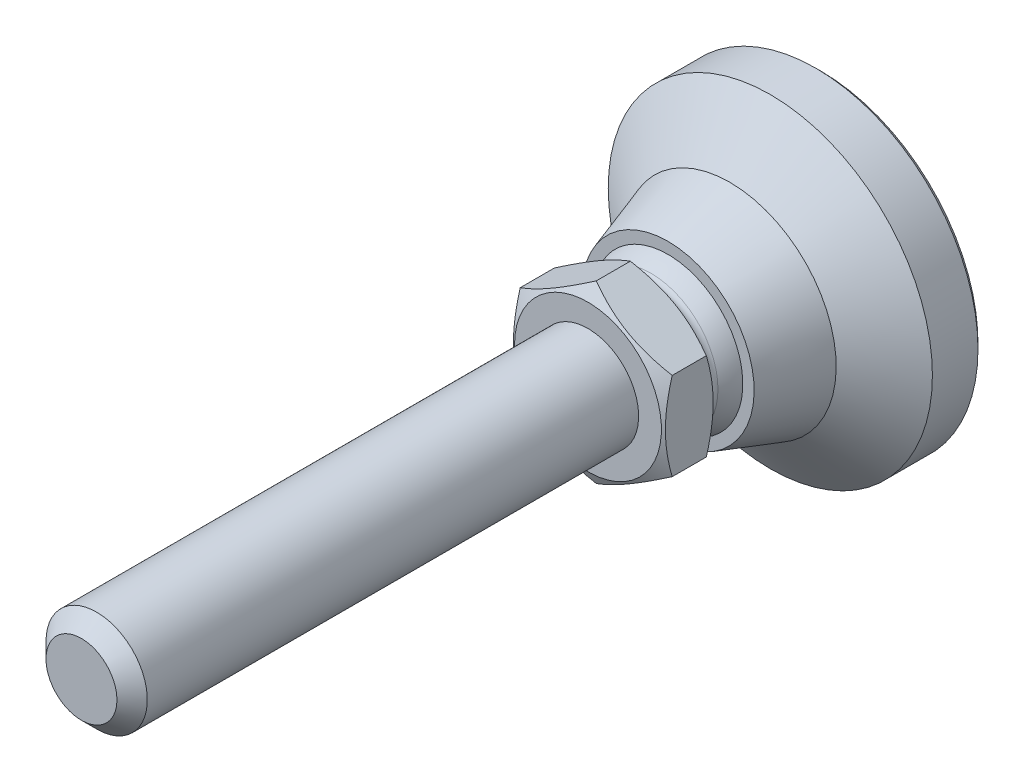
ISO-10303-21;
HEADER;
FILE_DESCRIPTION(('STEP AP214'),'2;1');
FILE_NAME('part.step','',(''),(''),'','','');
FILE_SCHEMA(('AUTOMOTIVE_DESIGN { 1 0 10303 214 1 1 1 1 }'));
ENDSEC;
DATA;
#1=APPLICATION_CONTEXT('core data for automotive mechanical design processes');
#2=APPLICATION_PROTOCOL_DEFINITION('international standard','automotive_design',2000,#1);
#3=PRODUCT_CONTEXT('',#1,'mechanical');
#4=PRODUCT('Part','Part','',(#3));
#5=PRODUCT_RELATED_PRODUCT_CATEGORY('part','',(#4));
#6=PRODUCT_DEFINITION_FORMATION('','',#4);
#7=PRODUCT_DEFINITION_CONTEXT('part definition',#1,'design');
#8=PRODUCT_DEFINITION('design','',#6,#7);
#9=PRODUCT_DEFINITION_SHAPE('','',#8);
#10=(LENGTH_UNIT() NAMED_UNIT(*) SI_UNIT(.MILLI.,.METRE.));
#11=(NAMED_UNIT(*) PLANE_ANGLE_UNIT() SI_UNIT($,.RADIAN.));
#12=(NAMED_UNIT(*) SI_UNIT($,.STERADIAN.) SOLID_ANGLE_UNIT());
#13=UNCERTAINTY_MEASURE_WITH_UNIT(LENGTH_MEASURE(1.E-05),#10,'distance_accuracy_value','');
#14=(GEOMETRIC_REPRESENTATION_CONTEXT(3) GLOBAL_UNCERTAINTY_ASSIGNED_CONTEXT((#13)) GLOBAL_UNIT_ASSIGNED_CONTEXT((#10,
#11,#12)) REPRESENTATION_CONTEXT('',''));
#15=CARTESIAN_POINT('',(0.,0.,0.));
#16=DIRECTION('',(0.,0.,1.));
#17=DIRECTION('',(1.,0.,0.));
#18=AXIS2_PLACEMENT_3D('',#15,#16,#17);
#19=CARTESIAN_POINT('',(0.,0.,17.2011230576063));
#20=DIRECTION('',(0.,0.,-1.));
#21=DIRECTION('',(0.,1.,0.));
#22=AXIS2_PLACEMENT_3D('',#19,#20,#21);
#23=TOROIDAL_SURFACE('',#22,7.30000010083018,0.799999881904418);
#24=CARTESIAN_POINT('',(0.,0.,18.0000000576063));
#25=DIRECTION('',(0.,0.,1.));
#26=DIRECTION('',(1.,0.,0.));
#27=AXIS2_PLACEMENT_3D('',#24,#25,#26);
#28=CIRCLE('',#27,7.25762853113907);
#29=CARTESIAN_POINT('',(7.25762853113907,0.,18.0000000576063));
#30=VERTEX_POINT('',#29);
#31=EDGE_CURVE('E78',#30,#30,#28,.F.);
#32=ORIENTED_EDGE('',*,*,#31,.T.);
#33=EDGE_LOOP('',(#32));
#34=FACE_BOUND('',#33,.T.);
#35=CARTESIAN_POINT('',(0.,0.,16.7846441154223));
#36=DIRECTION('',(0.,0.,-1.));
#37=DIRECTION('',(0.,1.,0.));
#38=AXIS2_PLACEMENT_3D('',#35,#36,#37);
#39=CIRCLE('',#38,6.61695903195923);
#40=CARTESIAN_POINT('',(-6.61695903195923,0.,16.7846441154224));
#41=VERTEX_POINT('',#40);
#42=EDGE_CURVE('E73',#41,#41,#39,.T.);
#43=ORIENTED_EDGE('',*,*,#42,.F.);
#44=EDGE_LOOP('',(#43));
#45=FACE_BOUND('',#44,.T.);
#46=ADVANCED_FACE('F14',(#34,#45),#23,.F.);
#47=CARTESIAN_POINT('',(0.,0.,12.7499999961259));
#48=DIRECTION('',(0.,0.,-1.));
#49=DIRECTION('',(-1.,0.,0.));
#50=AXIS2_PLACEMENT_3D('',#47,#48,#49);
#51=SPHERICAL_SURFACE('',#50,7.75);
#52=CARTESIAN_POINT('',(0.,0.,15.1));
#53=DIRECTION('',(0.,0.,-1.));
#54=DIRECTION('',(0.,1.,0.));
#55=AXIS2_PLACEMENT_3D('',#52,#53,#54);
#56=CIRCLE('',#55,7.38512017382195);
#57=CARTESIAN_POINT('',(-7.38512017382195,0.,15.1));
#58=VERTEX_POINT('',#57);
#59=EDGE_CURVE('E106',#58,#58,#56,.T.);
#60=CARTESIAN_POINT('',(-7.38512017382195,0.,15.1));
#61=CARTESIAN_POINT('',(-7.37925798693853,0.,15.1184225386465));
#62=CARTESIAN_POINT('',(-7.37332686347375,0.,15.1368231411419));
#63=CARTESIAN_POINT('',(-7.36132708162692,0.,15.1735794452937));
#64=CARTESIAN_POINT('',(-7.35525842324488,0.,15.1919351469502));
#65=CARTESIAN_POINT('',(-7.34298390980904,0.,15.2286006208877));
#66=CARTESIAN_POINT('',(-7.33677805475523,0.,15.2469103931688));
#67=CARTESIAN_POINT('',(-7.32422949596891,0.,15.2834829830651));
#68=CARTESIAN_POINT('',(-7.31788679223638,0.,15.3017458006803));
#69=CARTESIAN_POINT('',(-7.30506489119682,0.,15.3382234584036));
#70=CARTESIAN_POINT('',(-7.29858569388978,0.,15.3564382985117));
#71=CARTESIAN_POINT('',(-7.28549116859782,0.,15.3928189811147));
#72=CARTESIAN_POINT('',(-7.2788758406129,0.,15.4109848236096));
#73=CARTESIAN_POINT('',(-7.26550942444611,0.,15.4472664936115));
#74=CARTESIAN_POINT('',(-7.25875833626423,0.,15.4653823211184));
#75=CARTESIAN_POINT('',(-7.24512077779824,0.,15.5015629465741));
#76=CARTESIAN_POINT('',(-7.23823430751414,0.,15.5196277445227));
#77=CARTESIAN_POINT('',(-7.22432637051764,0.,15.5557052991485));
#78=CARTESIAN_POINT('',(-7.21730490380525,0.,15.5737180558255));
#79=CARTESIAN_POINT('',(-7.20312736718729,0.,15.6096905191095));
#80=CARTESIAN_POINT('',(-7.19597129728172,0.,15.6276502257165));
#81=CARTESIAN_POINT('',(-7.18152495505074,0.,15.6635155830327));
#82=CARTESIAN_POINT('',(-7.17423468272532,0.,15.6814212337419));
#83=CARTESIAN_POINT('',(-7.15952034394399,0.,15.7171774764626));
#84=CARTESIAN_POINT('',(-7.15209627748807,0.,15.735028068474));
#85=CARTESIAN_POINT('',(-7.13711476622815,0.,15.7706731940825));
#86=CARTESIAN_POINT('',(-7.12955732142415,0.,15.7884677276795));
#87=CARTESIAN_POINT('',(-7.11430947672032,0.,15.823999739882));
#88=CARTESIAN_POINT('',(-7.10661907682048,0.,15.8417372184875));
#89=CARTESIAN_POINT('',(-7.09110575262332,0.,15.8771541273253));
#90=CARTESIAN_POINT('',(-7.08328282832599,0.,15.8948335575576));
#91=CARTESIAN_POINT('',(-7.06750489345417,0.,15.9301333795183));
#92=CARTESIAN_POINT('',(-7.05954988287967,0.,15.9477537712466));
#93=CARTESIAN_POINT('',(-7.04350822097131,0.,15.982934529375));
#94=CARTESIAN_POINT('',(-7.03542156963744,0.,16.0004948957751));
#95=CARTESIAN_POINT('',(-7.01911707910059,0.,16.0355546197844));
#96=CARTESIAN_POINT('',(-7.01089923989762,0.,16.0530539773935));
#97=CARTESIAN_POINT('',(-6.99433283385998,0.,16.0879907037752));
#98=CARTESIAN_POINT('',(-6.98598426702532,0.,16.1054280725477));
#99=CARTESIAN_POINT('',(-6.96915687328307,0.,16.1402398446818));
#100=CARTESIAN_POINT('',(-6.96067804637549,0.,16.1576142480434));
#101=CARTESIAN_POINT('',(-6.94359060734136,0.,16.1922991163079));
#102=CARTESIAN_POINT('',(-6.9349819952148,0.,16.2096095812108));
#103=CARTESIAN_POINT('',(-6.91763546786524,0.,16.244165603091));
#104=CARTESIAN_POINT('',(-6.90889755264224,0.,16.2614111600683));
#105=CARTESIAN_POINT('',(-6.89129290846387,0.,16.2958364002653));
#106=CARTESIAN_POINT('',(-6.88242617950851,0.,16.3130160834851));
#107=CARTESIAN_POINT('',(-6.86456440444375,0.,16.3473086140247));
#108=CARTESIAN_POINT('',(-6.85556935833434,0.,16.3644214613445));
#109=CARTESIAN_POINT('',(-6.83745145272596,0.,16.3985793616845));
#110=CARTESIAN_POINT('',(-6.828328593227,0.,16.4156244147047));
#111=CARTESIAN_POINT('',(-6.80995557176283,0.,16.4496457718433));
#112=CARTESIAN_POINT('',(-6.80070540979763,0.,16.4666220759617));
#113=CARTESIAN_POINT('',(-6.78207830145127,0.,16.5005049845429));
#114=CARTESIAN_POINT('',(-6.77270135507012,0.,16.5174115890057));
#115=CARTESIAN_POINT('',(-6.75382120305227,0.,16.5511541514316));
#116=CARTESIAN_POINT('',(-6.74431799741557,0.,16.5679901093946));
#117=CARTESIAN_POINT('',(-6.72518585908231,0.,16.6015904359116));
#118=CARTESIAN_POINT('',(-6.71555692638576,0.,16.6183548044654));
#119=CARTESIAN_POINT('',(-6.69617387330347,0.,16.6518110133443));
#120=CARTESIAN_POINT('',(-6.68641975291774,0.,16.6685028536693));
#121=CARTESIAN_POINT('',(-6.66678687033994,0.,16.7018130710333));
#122=CARTESIAN_POINT('',(-6.65690810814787,0.,16.7184314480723));
#123=CARTESIAN_POINT('',(-6.63702649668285,0.,16.7515938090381));
#124=CARTESIAN_POINT('',(-6.6270236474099,0.,16.7681377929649));
#125=CARTESIAN_POINT('',(-6.61695903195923,0.,16.7846441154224));
#126=B_SPLINE_CURVE_WITH_KNOTS('',3,(#60,#61,#62,#63,#64,#65,#66,#67,#68,#69,#70,#71,#72,#73,
#74,#75,#76,#77,#78,#79,#80,#81,#82,#83,#84,#85,#86,#87,#88,#89,#90,#91,#92,#93,#94,#95,#96,#97,
#98,#99,#100,#101,#102,#103,#104,#105,#106,#107,#108,#109,#110,#111,#112,#113,#114,#115,#116,
#117,#118,#119,#120,#121,#122,#123,#124,#125),.UNSPECIFIED.,.F.,.F.,(4,2,2,2,2,2,2,2,2,2,2,2,2,
2,2,2,2,2,2,2,2,2,2,2,2,2,2,2,2,2,2,2,4),(0.,0.0579981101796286,0.11599622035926,
0.173994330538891,0.231992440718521,0.289990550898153,0.347988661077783,0.405986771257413,
0.463984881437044,0.521982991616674,0.579981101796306,0.637979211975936,0.695977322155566,
0.753975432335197,0.811973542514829,0.86997165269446,0.927969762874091,0.98596787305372,
1.04396598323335,1.10196409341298,1.15996220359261,1.21796031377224,1.27595842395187,
1.33395653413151,1.39195464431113,1.44995275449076,1.50795086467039,1.56594897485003,
1.62394708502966,1.68194519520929,1.73994330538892,1.79794141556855,1.85593952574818),.UNSPECIFIED.);
#127=EDGE_CURVE('BSEAM238',#58,#41,#126,.T.);
#128=ORIENTED_EDGE('',*,*,#59,.F.);
#129=ORIENTED_EDGE('',*,*,#42,.T.);
#130=ORIENTED_EDGE('',*,*,#127,.T.);
#131=ORIENTED_EDGE('',*,*,#127,.F.);
#132=EDGE_LOOP('',(#128,#130,#129,#131));
#133=FACE_BOUND('',#132,.T.);
#134=ADVANCED_FACE('F238',(#133),#51,.T.);
#135=CARTESIAN_POINT('',(-7.38512017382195,0.,15.1));
#136=DIRECTION('',(0.,0.,-1.));
#137=DIRECTION('',(0.,1.,0.));
#138=AXIS2_PLACEMENT_3D('',#135,#136,#137);
#139=PLANE('',#138);
#140=CARTESIAN_POINT('',(0.,0.,15.1));
#141=DIRECTION('',(0.,0.,-1.));
#142=DIRECTION('',(0.,1.,0.));
#143=AXIS2_PLACEMENT_3D('',#140,#141,#142);
#144=CIRCLE('',#143,8.5);
#145=CARTESIAN_POINT('',(0.,8.5,15.1));
#146=VERTEX_POINT('',#145);
#147=EDGE_CURVE('E103',#146,#146,#144,.T.);
#148=ORIENTED_EDGE('',*,*,#147,.F.);
#149=EDGE_LOOP('',(#148));
#150=FACE_BOUND('',#149,.T.);
#151=ORIENTED_EDGE('',*,*,#59,.T.);
#152=EDGE_LOOP('',(#151));
#153=FACE_BOUND('',#152,.T.);
#154=ADVANCED_FACE('F244',(#150,#153),#139,.F.);
#155=CARTESIAN_POINT('',(0.,0.,15.1));
#156=DIRECTION('',(0.,0.,-1.));
#157=DIRECTION('',(0.,1.,0.));
#158=AXIS2_PLACEMENT_3D('',#155,#156,#157);
#159=CONICAL_SURFACE('',#158,8.5,0.316824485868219);
#160=CARTESIAN_POINT('',(0.,0.,9.));
#161=DIRECTION('',(0.,0.,-1.));
#162=DIRECTION('',(0.,1.,0.));
#163=AXIS2_PLACEMENT_3D('',#160,#161,#162);
#164=CIRCLE('',#163,10.5);
#165=CARTESIAN_POINT('',(0.,10.5,9.));
#166=VERTEX_POINT('',#165);
#167=EDGE_CURVE('E100',#166,#166,#164,.T.);
#168=ORIENTED_EDGE('',*,*,#167,.F.);
#169=EDGE_LOOP('',(#168));
#170=FACE_BOUND('',#169,.T.);
#171=ORIENTED_EDGE('',*,*,#147,.T.);
#172=EDGE_LOOP('',(#171));
#173=FACE_BOUND('',#172,.T.);
#174=ADVANCED_FACE('F346',(#170,#173),#159,.T.);
#175=CARTESIAN_POINT('',(0.,0.,9.));
#176=DIRECTION('',(0.,0.,-1.));
#177=DIRECTION('',(0.,1.,0.));
#178=AXIS2_PLACEMENT_3D('',#175,#176,#177);
#179=CONICAL_SURFACE('',#178,10.5,0.942000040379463);
#180=CARTESIAN_POINT('',(0.,0.,5.));
#181=DIRECTION('',(0.,0.,-1.));
#182=DIRECTION('',(0.,1.,0.));
#183=AXIS2_PLACEMENT_3D('',#180,#181,#182);
#184=CIRCLE('',#183,16.);
#185=CARTESIAN_POINT('',(0.,16.,5.));
#186=VERTEX_POINT('',#185);
#187=EDGE_CURVE('E97',#186,#186,#184,.T.);
#188=ORIENTED_EDGE('',*,*,#187,.F.);
#189=EDGE_LOOP('',(#188));
#190=FACE_BOUND('',#189,.T.);
#191=ORIENTED_EDGE('',*,*,#167,.T.);
#192=EDGE_LOOP('',(#191));
#193=FACE_BOUND('',#192,.T.);
#194=ADVANCED_FACE('F355',(#190,#193),#179,.T.);
#195=CARTESIAN_POINT('',(0.,0.,0.));
#196=DIRECTION('',(0.,0.,-1.));
#197=DIRECTION('',(0.,1.,0.));
#198=AXIS2_PLACEMENT_3D('',#195,#196,#197);
#199=CYLINDRICAL_SURFACE('',#198,16.);
#200=CARTESIAN_POINT('',(0.,0.,0.5));
#201=DIRECTION('',(0.,0.,-1.));
#202=DIRECTION('',(0.,1.,0.));
#203=AXIS2_PLACEMENT_3D('',#200,#201,#202);
#204=CIRCLE('',#203,16.);
#205=CARTESIAN_POINT('',(0.,16.,0.5));
#206=VERTEX_POINT('',#205);
#207=EDGE_CURVE('E89',#206,#206,#204,.T.);
#208=ORIENTED_EDGE('',*,*,#207,.F.);
#209=EDGE_LOOP('',(#208));
#210=FACE_BOUND('',#209,.T.);
#211=ORIENTED_EDGE('',*,*,#187,.T.);
#212=EDGE_LOOP('',(#211));
#213=FACE_BOUND('',#212,.T.);
#214=ADVANCED_FACE('F364',(#210,#213),#199,.T.);
#215=CARTESIAN_POINT('',(0.,0.,0.5));
#216=DIRECTION('',(0.,0.,1.));
#217=DIRECTION('',(0.,-1.,0.));
#218=AXIS2_PLACEMENT_3D('',#215,#216,#217);
#219=CONICAL_SURFACE('',#218,16.,0.785398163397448);
#220=CARTESIAN_POINT('',(0.,0.,0.));
#221=DIRECTION('',(0.,0.,-1.));
#222=DIRECTION('',(0.,1.,0.));
#223=AXIS2_PLACEMENT_3D('',#220,#221,#222);
#224=CIRCLE('',#223,15.5);
#225=CARTESIAN_POINT('',(0.,15.5,0.));
#226=VERTEX_POINT('',#225);
#227=EDGE_CURVE('E85',#226,#226,#224,.T.);
#228=ORIENTED_EDGE('',*,*,#227,.F.);
#229=EDGE_LOOP('',(#228));
#230=FACE_BOUND('',#229,.T.);
#231=ORIENTED_EDGE('',*,*,#207,.T.);
#232=EDGE_LOOP('',(#231));
#233=FACE_BOUND('',#232,.T.);
#234=ADVANCED_FACE('F269',(#230,#233),#219,.T.);
#235=CARTESIAN_POINT('',(0.,0.,0.));
#236=DIRECTION('',(0.,0.,1.));
#237=DIRECTION('',(0.,-1.,0.));
#238=AXIS2_PLACEMENT_3D('',#235,#236,#237);
#239=PLANE('',#238);
#240=ORIENTED_EDGE('',*,*,#227,.T.);
#241=EDGE_LOOP('',(#240));
#242=FACE_BOUND('',#241,.T.);
#243=ADVANCED_FACE('F264',(#242),#239,.F.);
#244=CARTESIAN_POINT('',(0.,7.25,18.0000000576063));
#245=DIRECTION('',(0.,0.,-1.));
#246=DIRECTION('',(-1.,0.,0.));
#247=AXIS2_PLACEMENT_3D('',#244,#245,#246);
#248=PLANE('',#247);
#249=CARTESIAN_POINT('',(0.,0.,18.0000000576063));
#250=DIRECTION('',(0.,0.,-1.));
#251=DIRECTION('',(-1.,0.,0.));
#252=AXIS2_PLACEMENT_3D('',#249,#250,#251);
#253=CIRCLE('',#252,7.25);
#254=CARTESIAN_POINT('',(-7.25,0.,18.0000000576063));
#255=VERTEX_POINT('',#254);
#256=EDGE_CURVE('E273',#255,#255,#253,.T.);
#257=ORIENTED_EDGE('',*,*,#256,.T.);
#258=EDGE_LOOP('',(#257));
#259=FACE_BOUND('',#258,.T.);
#260=ORIENTED_EDGE('',*,*,#31,.F.);
#261=EDGE_LOOP('',(#260));
#262=FACE_BOUND('',#261,.T.);
#263=ADVANCED_FACE('F126',(#259,#262),#248,.F.);
#264=CARTESIAN_POINT('',(0.,0.,19.4875466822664));
#265=DIRECTION('',(0.,0.,1.));
#266=DIRECTION('',(1.,0.,0.));
#267=AXIS2_PLACEMENT_3D('',#264,#265,#266);
#268=CONICAL_SURFACE('',#267,9.82650633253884,1.0471975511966);
#269=CARTESIAN_POINT('',(-0.000199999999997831,8.66036950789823,18.8142772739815));
#270=CARTESIAN_POINT('',(0.164658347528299,8.56518849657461,18.75933289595));
#271=CARTESIAN_POINT('',(0.330131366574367,8.46965260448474,18.7068821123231));
#272=CARTESIAN_POINT('',(0.662421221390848,8.27780496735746,18.607654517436));
#273=CARTESIAN_POINT('',(0.829238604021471,8.18149290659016,18.5608801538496));
#274=CARTESIAN_POINT('',(1.33236168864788,7.89101465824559,18.4299898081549));
#275=CARTESIAN_POINT('',(1.67065338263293,7.69570185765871,18.3555409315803));
#276=CARTESIAN_POINT('',(2.17690074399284,7.40341980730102,18.2682409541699));
#277=CARTESIAN_POINT('',(2.34334381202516,7.30732385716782,18.2433717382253));
#278=CARTESIAN_POINT('',(2.67698200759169,7.11469775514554,18.2016697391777));
#279=CARTESIAN_POINT('',(2.84417706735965,7.01816764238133,18.1848362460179));
#280=CARTESIAN_POINT('',(3.17885756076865,6.82493976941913,18.1596346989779));
#281=CARTESIAN_POINT('',(3.34634244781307,6.72824232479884,18.1512570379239));
#282=CARTESIAN_POINT('',(3.68145767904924,6.5347634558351,18.1431378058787));
#283=CARTESIAN_POINT('',(3.84908801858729,6.43798203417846,18.1433959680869));
#284=CARTESIAN_POINT('',(4.30833780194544,6.17283404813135,18.1559736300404));
#285=CARTESIAN_POINT('',(4.59980690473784,6.0045542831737,18.1770872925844));
#286=CARTESIAN_POINT('',(5.18080920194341,5.66911245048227,18.2440382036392));
#287=CARTESIAN_POINT('',(5.47034035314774,5.50195156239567,18.2898983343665));
#288=CARTESIAN_POINT('',(6.05251186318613,5.16583468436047,18.404535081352));
#289=CARTESIAN_POINT('',(6.34507876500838,4.99692110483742,18.4737973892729));
#290=CARTESIAN_POINT('',(6.92584963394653,4.66161288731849,18.6309947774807));
#291=CARTESIAN_POINT('',(7.21406103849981,4.49521395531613,18.7188929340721));
#292=CARTESIAN_POINT('',(7.5002,4.33001154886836,18.8142772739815));
#293=B_SPLINE_CURVE_WITH_KNOTS('',3,(#269,#270,#271,#272,#273,#274,#275,#276,#277,#278,#279,
#280,#281,#282,#283,#284,#285,#286,#287,#288,#289,#290,#291,#292),.UNSPECIFIED.,.F.,.F.,(4,2,2,
2,2,2,2,2,2,2,2,4),(0.,0.594350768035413,1.1889569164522,2.38063993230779,2.96188692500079,
3.54308254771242,4.12361709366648,4.70413370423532,5.71473675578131,6.72627588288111,
7.76024925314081,8.7921928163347),.UNSPECIFIED.);
#294=CARTESIAN_POINT('',(0.,8.66025403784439,18.8142106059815));
#295=VERTEX_POINT('',#294);
#296=CARTESIAN_POINT('',(7.5,4.3301270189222,18.8142106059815));
#297=VERTEX_POINT('',#296);
#298=EDGE_CURVE('E69',#295,#297,#293,.T.);
#299=ORIENTED_EDGE('',*,*,#298,.T.);
#300=CARTESIAN_POINT('',(7.5,-11.5576706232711,21.768868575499));
#301=CARTESIAN_POINT('',(7.5,-11.2307045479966,21.6105580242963));
#302=CARTESIAN_POINT('',(7.5,-10.9029799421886,21.4537868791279));
#303=CARTESIAN_POINT('',(7.5,-10.2456099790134,21.1441907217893));
#304=CARTESIAN_POINT('',(7.5,-9.91596432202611,20.9913663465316));
#305=CARTESIAN_POINT('',(7.5,-9.25261455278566,20.6897463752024));
#306=CARTESIAN_POINT('',(7.5,-8.91889806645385,20.5409778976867));
#307=CARTESIAN_POINT('',(7.5,-8.24878495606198,20.2496282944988));
#308=CARTESIAN_POINT('',(7.5,-7.91238846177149,20.1070468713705));
#309=CARTESIAN_POINT('',(7.5,-7.22581294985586,19.8253721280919));
#310=CARTESIAN_POINT('',(7.5,-6.87553160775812,19.6865268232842));
#311=CARTESIAN_POINT('',(7.5,-6.17084463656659,19.4195238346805));
#312=CARTESIAN_POINT('',(7.5,-5.81643854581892,19.2913673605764));
#313=CARTESIAN_POINT('',(7.5,-5.10362143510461,19.0491608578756));
#314=CARTESIAN_POINT('',(7.5,-4.74522044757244,18.93508162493));
#315=CARTESIAN_POINT('',(7.5,-4.02329140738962,18.724736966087));
#316=CARTESIAN_POINT('',(7.5,-3.6597650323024,18.6284658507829));
#317=CARTESIAN_POINT('',(7.5,-2.92931943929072,18.4589198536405));
#318=CARTESIAN_POINT('',(7.5,-2.56242928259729,18.3855231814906));
#319=CARTESIAN_POINT('',(7.5,-2.00881272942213,18.2957984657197));
#320=CARTESIAN_POINT('',(7.5,-1.82371282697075,18.2692840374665));
#321=CARTESIAN_POINT('',(7.5,-1.45261823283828,18.2235669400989));
#322=CARTESIAN_POINT('',(7.5,-1.26662362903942,18.2043635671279));
#323=CARTESIAN_POINT('',(7.5,-0.89638602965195,18.1738882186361));
#324=CARTESIAN_POINT('',(7.5,-0.712151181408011,18.1625176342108));
#325=CARTESIAN_POINT('',(7.5,-0.343366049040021,18.1475723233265));
#326=CARTESIAN_POINT('',(7.5,-0.158815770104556,18.1439974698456));
#327=CARTESIAN_POINT('',(7.5,0.21027122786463,18.1447287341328));
#328=CARTESIAN_POINT('',(7.5,0.394807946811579,18.1490348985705));
#329=CARTESIAN_POINT('',(7.5,0.763538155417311,18.1654242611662));
#330=CARTESIAN_POINT('',(7.5,0.947731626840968,18.1775078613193));
#331=CARTESIAN_POINT('',(7.5,1.39266066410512,18.2158368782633));
#332=CARTESIAN_POINT('',(7.5,1.65307425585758,18.2458975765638));
#333=CARTESIAN_POINT('',(7.5,2.17190768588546,18.3199074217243));
#334=CARTESIAN_POINT('',(7.5,2.43032723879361,18.3638585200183));
#335=CARTESIAN_POINT('',(7.5,3.20233370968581,18.5142115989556));
#336=CARTESIAN_POINT('',(7.5,3.71236757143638,18.6390840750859));
#337=CARTESIAN_POINT('',(7.5,4.47490816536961,18.8548537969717));
#338=CARTESIAN_POINT('',(7.5,4.73138930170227,18.9325065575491));
#339=CARTESIAN_POINT('',(7.5,5.24185921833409,19.0956852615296));
#340=CARTESIAN_POINT('',(7.5,5.49584798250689,19.1812112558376));
#341=CARTESIAN_POINT('',(7.5,6.00141679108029,19.3587802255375));
#342=CARTESIAN_POINT('',(7.5,6.25299764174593,19.4508209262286));
#343=CARTESIAN_POINT('',(7.5,6.75408794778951,19.6403555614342));
#344=CARTESIAN_POINT('',(7.5,7.00359742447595,19.737849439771));
#345=CARTESIAN_POINT('',(7.5,7.58002840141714,19.9691873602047));
#346=CARTESIAN_POINT('',(7.5,7.90627393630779,20.1047123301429));
#347=CARTESIAN_POINT('',(7.5,8.55609583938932,20.3820345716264));
#348=CARTESIAN_POINT('',(7.5,8.87967206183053,20.5238321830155));
#349=CARTESIAN_POINT('',(7.5,9.52463038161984,20.8124742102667));
#350=CARTESIAN_POINT('',(7.5,9.84601206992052,20.9593195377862));
#351=CARTESIAN_POINT('',(7.5,10.4868901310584,21.2570751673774));
#352=CARTESIAN_POINT('',(7.5,10.8063864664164,21.4079855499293));
#353=CARTESIAN_POINT('',(7.5,11.4441033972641,21.7132759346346));
#354=CARTESIAN_POINT('',(7.5,11.762322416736,21.8676592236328));
#355=CARTESIAN_POINT('',(7.5,12.3974133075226,22.1791747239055));
#356=CARTESIAN_POINT('',(7.5,12.714285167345,22.3363069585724));
#357=CARTESIAN_POINT('',(7.5,13.6631175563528,22.8110756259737));
#358=CARTESIAN_POINT('',(7.5,14.2933721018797,23.1321212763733));
#359=CARTESIAN_POINT('',(7.5,15.4999002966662,23.7545318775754));
#360=CARTESIAN_POINT('',(7.5,16.0764321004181,24.0553985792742));
#361=CARTESIAN_POINT('',(7.5,17.2273435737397,24.6612616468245));
#362=CARTESIAN_POINT('',(7.5,17.8017231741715,24.9662581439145));
#363=CARTESIAN_POINT('',(7.5,18.947459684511,25.5786959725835));
#364=CARTESIAN_POINT('',(7.5,19.5188205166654,25.8861299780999));
#365=CARTESIAN_POINT('',(7.5,20.6601587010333,26.5034864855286));
#366=CARTESIAN_POINT('',(7.5,21.2301361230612,26.8134088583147));
#367=CARTESIAN_POINT('',(7.5,21.7996007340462,27.1242643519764));
#368=B_SPLINE_CURVE_WITH_KNOTS('',3,(#300,#301,#302,#303,#304,#305,#306,#307,#308,#309,#310,
#311,#312,#313,#314,#315,#316,#317,#318,#319,#320,#321,#322,#323,#324,#325,#326,#327,#328,#329,
#330,#331,#332,#333,#334,#335,#336,#337,#338,#339,#340,#341,#342,#343,#344,#345,#346,#347,#348,
#349,#350,#351,#352,#353,#354,#355,#356,#357,#358,#359,#360,#361,#362,#363,#364,#365,#366,#367),
.UNSPECIFIED.,.F.,.F.,(4,2,2,2,2,2,2,2,2,2,2,2,2,2,2,2,2,2,2,2,2,2,2,2,2,2,2,2,2,2,2,2,2,4),(0.,
1.08983998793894,2.17985476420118,3.27592891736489,4.37195031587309,5.50220226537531,
6.63258195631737,7.76057568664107,8.88820841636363,10.0097304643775,10.5705765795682,
11.131368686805,11.6849650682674,12.2385524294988,12.7921430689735,13.3457623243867,
14.131745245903,14.9178386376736,16.4909282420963,17.2947994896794,18.0986759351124,
18.9022730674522,19.7058619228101,20.7655995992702,21.8253947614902,22.8853823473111,
23.945390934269,25.0064488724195,26.0675158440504,28.1893926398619,30.1403199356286,
32.0913093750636,34.0377662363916,35.9841227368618),.UNSPECIFIED.);
#369=CARTESIAN_POINT('',(7.5,-4.3301270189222,18.8142106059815));
#370=VERTEX_POINT('',#369);
#371=EDGE_CURVE('E79',#297,#370,#368,.F.);
#372=ORIENTED_EDGE('',*,*,#371,.T.);
#373=CARTESIAN_POINT('',(7.5002,-4.33001154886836,18.8142772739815));
#374=CARTESIAN_POINT('',(7.3353416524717,-4.42519256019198,18.75933289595));
#375=CARTESIAN_POINT('',(7.16986863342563,-4.52072845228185,18.7068821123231));
#376=CARTESIAN_POINT('',(6.83757877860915,-4.71257608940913,18.607654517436));
#377=CARTESIAN_POINT('',(6.67076139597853,-4.80888815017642,18.5608801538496));
#378=CARTESIAN_POINT('',(6.16763831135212,-5.09936639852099,18.4299898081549));
#379=CARTESIAN_POINT('',(5.82934661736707,-5.29467919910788,18.3555409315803));
#380=CARTESIAN_POINT('',(5.32309925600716,-5.58696124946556,18.26824095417));
#381=CARTESIAN_POINT('',(5.15665618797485,-5.68305719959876,18.2433717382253));
#382=CARTESIAN_POINT('',(4.82301799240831,-5.87568330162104,18.2016697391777));
#383=CARTESIAN_POINT('',(4.65582293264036,-5.97221341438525,18.1848362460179));
#384=CARTESIAN_POINT('',(4.32114243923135,-6.16544128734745,18.1596346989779));
#385=CARTESIAN_POINT('',(4.15365755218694,-6.26213873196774,18.1512570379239));
#386=CARTESIAN_POINT('',(3.81854232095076,-6.45561760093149,18.1431378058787));
#387=CARTESIAN_POINT('',(3.65091198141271,-6.55239902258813,18.1433959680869));
#388=CARTESIAN_POINT('',(3.19166219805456,-6.81754700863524,18.1559736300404));
#389=CARTESIAN_POINT('',(2.90019309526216,-6.98582677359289,18.1770872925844));
#390=CARTESIAN_POINT('',(2.31919079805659,-7.32126860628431,18.2440382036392));
#391=CARTESIAN_POINT('',(2.02965964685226,-7.48842949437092,18.2898983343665));
#392=CARTESIAN_POINT('',(1.44748813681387,-7.82454637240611,18.404535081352));
#393=CARTESIAN_POINT('',(1.15492123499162,-7.99345995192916,18.4737973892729));
#394=CARTESIAN_POINT('',(0.574150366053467,-8.3287681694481,18.6309947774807));
#395=CARTESIAN_POINT('',(0.285938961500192,-8.49516710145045,18.7188929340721));
#396=CARTESIAN_POINT('',(-0.000200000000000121,-8.66036950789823,18.8142772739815));
#397=B_SPLINE_CURVE_WITH_KNOTS('',3,(#373,#374,#375,#376,#377,#378,#379,#380,#381,#382,#383,
#384,#385,#386,#387,#388,#389,#390,#391,#392,#393,#394,#395,#396),.UNSPECIFIED.,.F.,.F.,(4,2,2,
2,2,2,2,2,2,2,2,4),(0.,0.594350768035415,1.1889569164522,2.38063993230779,2.96188692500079,
3.54308254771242,4.12361709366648,4.70413370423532,5.71473675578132,6.72627588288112,
7.76024925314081,8.79219281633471),.UNSPECIFIED.);
#398=CARTESIAN_POINT('',(0.,-8.66025403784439,18.8142106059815));
#399=VERTEX_POINT('',#398);
#400=EDGE_CURVE('E148',#370,#399,#397,.T.);
#401=ORIENTED_EDGE('',*,*,#400,.T.);
#402=CARTESIAN_POINT('',(0.000199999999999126,-8.66036950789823,18.8142772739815));
#403=CARTESIAN_POINT('',(-0.164658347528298,-8.56518849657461,18.75933289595));
#404=CARTESIAN_POINT('',(-0.330131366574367,-8.46965260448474,18.7068821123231));
#405=CARTESIAN_POINT('',(-0.662421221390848,-8.27780496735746,18.607654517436));
#406=CARTESIAN_POINT('',(-0.829238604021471,-8.18149290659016,18.5608801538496));
#407=CARTESIAN_POINT('',(-1.33236168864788,-7.89101465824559,18.4299898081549));
#408=CARTESIAN_POINT('',(-1.67065338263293,-7.69570185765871,18.3555409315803));
#409=CARTESIAN_POINT('',(-2.17690074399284,-7.40341980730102,18.2682409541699));
#410=CARTESIAN_POINT('',(-2.34334381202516,-7.30732385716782,18.2433717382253));
#411=CARTESIAN_POINT('',(-2.67698200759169,-7.11469775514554,18.2016697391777));
#412=CARTESIAN_POINT('',(-2.84417706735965,-7.01816764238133,18.1848362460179));
#413=CARTESIAN_POINT('',(-3.17885756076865,-6.82493976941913,18.1596346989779));
#414=CARTESIAN_POINT('',(-3.34634244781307,-6.72824232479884,18.1512570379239));
#415=CARTESIAN_POINT('',(-3.68145767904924,-6.53476345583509,18.1431378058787));
#416=CARTESIAN_POINT('',(-3.84908801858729,-6.43798203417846,18.1433959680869));
#417=CARTESIAN_POINT('',(-4.30833780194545,-6.17283404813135,18.1559736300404));
#418=CARTESIAN_POINT('',(-4.59980690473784,-6.0045542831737,18.1770872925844));
#419=CARTESIAN_POINT('',(-5.18080920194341,-5.66911245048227,18.2440382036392));
#420=CARTESIAN_POINT('',(-5.47034035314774,-5.50195156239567,18.2898983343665));
#421=CARTESIAN_POINT('',(-6.05251186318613,-5.16583468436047,18.404535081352));
#422=CARTESIAN_POINT('',(-6.34507876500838,-4.99692110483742,18.4737973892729));
#423=CARTESIAN_POINT('',(-6.92584963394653,-4.66161288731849,18.6309947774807));
#424=CARTESIAN_POINT('',(-7.21406103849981,-4.49521395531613,18.7188929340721));
#425=CARTESIAN_POINT('',(-7.5002,-4.33001154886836,18.8142772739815));
#426=B_SPLINE_CURVE_WITH_KNOTS('',3,(#402,#403,#404,#405,#406,#407,#408,#409,#410,#411,#412,
#413,#414,#415,#416,#417,#418,#419,#420,#421,#422,#423,#424,#425),.UNSPECIFIED.,.F.,.F.,(4,2,2,
2,2,2,2,2,2,2,2,4),(0.,0.594350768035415,1.1889569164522,2.38063993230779,2.96188692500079,
3.54308254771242,4.12361709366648,4.70413370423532,5.71473675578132,6.72627588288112,
7.76024925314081,8.79219281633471),.UNSPECIFIED.);
#427=CARTESIAN_POINT('',(-7.5,-4.3301270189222,18.8142106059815));
#428=VERTEX_POINT('',#427);
#429=EDGE_CURVE('E141',#399,#428,#426,.T.);
#430=ORIENTED_EDGE('',*,*,#429,.T.);
#431=CARTESIAN_POINT('',(-7.5,-11.5576706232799,21.7688685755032));
#432=CARTESIAN_POINT('',(-7.5,-11.230704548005,21.6105580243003));
#433=CARTESIAN_POINT('',(-7.5,-10.9029799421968,21.4537868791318));
#434=CARTESIAN_POINT('',(-7.5,-10.245609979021,21.1441907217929));
#435=CARTESIAN_POINT('',(-7.5,-9.91596432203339,20.9913663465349));
#436=CARTESIAN_POINT('',(-7.5,-9.25261455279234,20.6897463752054));
#437=CARTESIAN_POINT('',(-7.5,-8.91889806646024,20.5409778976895));
#438=CARTESIAN_POINT('',(-7.5,-8.24878495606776,20.2496282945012));
#439=CARTESIAN_POINT('',(-7.5,-7.91238846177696,20.1070468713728));
#440=CARTESIAN_POINT('',(-7.5,-7.22581294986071,19.8253721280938));
#441=CARTESIAN_POINT('',(-7.5,-6.87553160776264,19.686526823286));
#442=CARTESIAN_POINT('',(-7.5,-6.17084463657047,19.4195238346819));
#443=CARTESIAN_POINT('',(-7.5,-5.81643854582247,19.2913673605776));
#444=CARTESIAN_POINT('',(-7.5,-5.10362143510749,19.0491608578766));
#445=CARTESIAN_POINT('',(-7.5,-4.74522044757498,18.9350816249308));
#446=CARTESIAN_POINT('',(-7.5,-4.02329140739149,18.7247369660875));
#447=CARTESIAN_POINT('',(-7.5,-3.65976503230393,18.6284658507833));
#448=CARTESIAN_POINT('',(-7.5,-2.92931943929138,18.4589198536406));
#449=CARTESIAN_POINT('',(-7.5,-2.56242928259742,18.3855231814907));
#450=CARTESIAN_POINT('',(-7.5,-2.00881272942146,18.2957984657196));
#451=CARTESIAN_POINT('',(-7.5,-1.82371282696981,18.2692840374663));
#452=CARTESIAN_POINT('',(-7.5,-1.4526182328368,18.2235669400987));
#453=CARTESIAN_POINT('',(-7.5,-1.26662362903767,18.2043635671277));
#454=CARTESIAN_POINT('',(-7.5,-0.896386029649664,18.173888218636));
#455=CARTESIAN_POINT('',(-7.5,-0.712151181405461,18.1625176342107));
#456=CARTESIAN_POINT('',(-7.5,-0.343366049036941,18.1475723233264));
#457=CARTESIAN_POINT('',(-7.5,-0.158815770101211,18.1439974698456));
#458=CARTESIAN_POINT('',(-7.5,0.210271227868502,18.1447287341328));
#459=CARTESIAN_POINT('',(-7.5,0.394807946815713,18.1490348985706));
#460=CARTESIAN_POINT('',(-7.5,0.763538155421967,18.1654242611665));
#461=CARTESIAN_POINT('',(-7.5,0.947731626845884,18.1775078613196));
#462=CARTESIAN_POINT('',(-7.5,1.39266066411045,18.2158368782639));
#463=CARTESIAN_POINT('',(-7.5,1.65307425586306,18.2458975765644));
#464=CARTESIAN_POINT('',(-7.5,2.17190768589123,18.3199074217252));
#465=CARTESIAN_POINT('',(-7.5,2.43032723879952,18.3638585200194));
#466=CARTESIAN_POINT('',(-7.5,3.20233370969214,18.5142115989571));
#467=CARTESIAN_POINT('',(-7.5,3.71236757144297,18.6390840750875));
#468=CARTESIAN_POINT('',(-7.5,4.47490816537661,18.8548537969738));
#469=CARTESIAN_POINT('',(-7.5,4.7313893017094,18.9325065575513));
#470=CARTESIAN_POINT('',(-7.5,5.24185921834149,19.095685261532));
#471=CARTESIAN_POINT('',(-7.5,5.49584798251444,19.1812112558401));
#472=CARTESIAN_POINT('',(-7.5,6.0014167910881,19.3587802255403));
#473=CARTESIAN_POINT('',(-7.5,6.25299764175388,19.4508209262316));
#474=CARTESIAN_POINT('',(-7.5,6.75408794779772,19.6403555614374));
#475=CARTESIAN_POINT('',(-7.5,7.0035974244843,19.7378494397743));
#476=CARTESIAN_POINT('',(-7.5,7.58002840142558,19.9691873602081));
#477=CARTESIAN_POINT('',(-7.5,7.90627393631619,20.1047123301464));
#478=CARTESIAN_POINT('',(-7.5,8.55609583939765,20.38203457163));
#479=CARTESIAN_POINT('',(-7.5,8.87967206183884,20.5238321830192));
#480=CARTESIAN_POINT('',(-7.5,9.52463038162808,20.8124742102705));
#481=CARTESIAN_POINT('',(-7.5,9.84601206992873,20.95931953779));
#482=CARTESIAN_POINT('',(-7.5,10.4868901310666,21.2570751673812));
#483=CARTESIAN_POINT('',(-7.5,10.8063864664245,21.4079855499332));
#484=CARTESIAN_POINT('',(-7.5,11.4441033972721,21.7132759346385));
#485=CARTESIAN_POINT('',(-7.5,11.7623224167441,21.8676592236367));
#486=CARTESIAN_POINT('',(-7.5,12.3974133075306,22.1791747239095));
#487=CARTESIAN_POINT('',(-7.5,12.714285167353,22.3363069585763));
#488=CARTESIAN_POINT('',(-7.5,13.6631175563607,22.8110756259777));
#489=CARTESIAN_POINT('',(-7.5,14.2933721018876,23.1321212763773));
#490=CARTESIAN_POINT('',(-7.5,15.499900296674,23.7545318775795));
#491=CARTESIAN_POINT('',(-7.5,16.0764321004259,24.0553985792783));
#492=CARTESIAN_POINT('',(-7.5,17.2273435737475,24.6612616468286));
#493=CARTESIAN_POINT('',(-7.5,17.8017231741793,24.9662581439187));
#494=CARTESIAN_POINT('',(-7.5,18.9474596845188,25.5786959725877));
#495=CARTESIAN_POINT('',(-7.5,19.5188205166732,25.8861299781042));
#496=CARTESIAN_POINT('',(-7.5,20.6601587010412,26.5034864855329));
#497=CARTESIAN_POINT('',(-7.5,21.2301361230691,26.8134088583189));
#498=CARTESIAN_POINT('',(-7.5,21.7996007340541,27.1242643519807));
#499=B_SPLINE_CURVE_WITH_KNOTS('',3,(#431,#432,#433,#434,#435,#436,#437,#438,#439,#440,#441,
#442,#443,#444,#445,#446,#447,#448,#449,#450,#451,#452,#453,#454,#455,#456,#457,#458,#459,#460,
#461,#462,#463,#464,#465,#466,#467,#468,#469,#470,#471,#472,#473,#474,#475,#476,#477,#478,#479,
#480,#481,#482,#483,#484,#485,#486,#487,#488,#489,#490,#491,#492,#493,#494,#495,#496,#497,#498),
.UNSPECIFIED.,.F.,.F.,(4,2,2,2,2,2,2,2,2,2,2,2,2,2,2,2,2,2,2,2,2,2,2,2,2,2,2,2,2,2,2,2,2,4),(0.,
1.08983998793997,2.17985476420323,3.27592891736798,4.37195031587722,5.50220226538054,
6.6325819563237,7.76057568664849,8.88820841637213,10.0097304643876,10.5705765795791,
11.1313686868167,11.68496506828,12.2385524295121,12.7921430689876,13.3457623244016,
14.1317452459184,14.9178386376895,16.4909282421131,17.2947994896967,18.0986759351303,
18.9022730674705,19.705861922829,20.7655995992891,21.825394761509,22.8853823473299,
23.9453909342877,25.0064488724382,26.067515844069,28.1893926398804,30.1403199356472,
32.0913093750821,34.0377662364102,35.9841227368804),.UNSPECIFIED.);
#500=CARTESIAN_POINT('',(-7.5,4.3301270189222,18.8142106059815));
#501=VERTEX_POINT('',#500);
#502=EDGE_CURVE('E29',#428,#501,#499,.T.);
#503=ORIENTED_EDGE('',*,*,#502,.T.);
#504=CARTESIAN_POINT('',(-7.5002,4.33001154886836,18.8142772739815));
#505=CARTESIAN_POINT('',(-7.3353416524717,4.42519256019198,18.75933289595));
#506=CARTESIAN_POINT('',(-7.16986863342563,4.52072845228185,18.7068821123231));
#507=CARTESIAN_POINT('',(-6.83757877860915,4.71257608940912,18.607654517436));
#508=CARTESIAN_POINT('',(-6.67076139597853,4.80888815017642,18.5608801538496));
#509=CARTESIAN_POINT('',(-6.16763831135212,5.09936639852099,18.4299898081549));
#510=CARTESIAN_POINT('',(-5.82934661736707,5.29467919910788,18.3555409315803));
#511=CARTESIAN_POINT('',(-5.32309925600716,5.58696124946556,18.26824095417));
#512=CARTESIAN_POINT('',(-5.15665618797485,5.68305719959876,18.2433717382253));
#513=CARTESIAN_POINT('',(-4.82301799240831,5.87568330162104,18.2016697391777));
#514=CARTESIAN_POINT('',(-4.65582293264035,5.97221341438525,18.1848362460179));
#515=CARTESIAN_POINT('',(-4.32114243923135,6.16544128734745,18.1596346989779));
#516=CARTESIAN_POINT('',(-4.15365755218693,6.26213873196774,18.1512570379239));
#517=CARTESIAN_POINT('',(-3.81854232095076,6.45561760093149,18.1431378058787));
#518=CARTESIAN_POINT('',(-3.65091198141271,6.55239902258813,18.1433959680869));
#519=CARTESIAN_POINT('',(-3.19166219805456,6.81754700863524,18.1559736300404));
#520=CARTESIAN_POINT('',(-2.90019309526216,6.98582677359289,18.1770872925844));
#521=CARTESIAN_POINT('',(-2.31919079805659,7.32126860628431,18.2440382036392));
#522=CARTESIAN_POINT('',(-2.02965964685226,7.48842949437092,18.2898983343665));
#523=CARTESIAN_POINT('',(-1.44748813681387,7.82454637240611,18.404535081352));
#524=CARTESIAN_POINT('',(-1.15492123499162,7.99345995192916,18.4737973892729));
#525=CARTESIAN_POINT('',(-0.574150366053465,8.3287681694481,18.6309947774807));
#526=CARTESIAN_POINT('',(-0.28593896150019,8.49516710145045,18.7188929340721));
#527=CARTESIAN_POINT('',(0.000200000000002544,8.66036950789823,18.8142772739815));
#528=B_SPLINE_CURVE_WITH_KNOTS('',3,(#504,#505,#506,#507,#508,#509,#510,#511,#512,#513,#514,
#515,#516,#517,#518,#519,#520,#521,#522,#523,#524,#525,#526,#527),.UNSPECIFIED.,.F.,.F.,(4,2,2,
2,2,2,2,2,2,2,2,4),(0.,0.594350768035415,1.1889569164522,2.38063993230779,2.96188692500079,
3.54308254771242,4.12361709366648,4.70413370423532,5.71473675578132,6.72627588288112,
7.76024925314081,8.79219281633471),.UNSPECIFIED.);
#529=EDGE_CURVE('E66',#501,#295,#528,.T.);
#530=ORIENTED_EDGE('',*,*,#529,.T.);
#531=EDGE_LOOP('',(#299,#372,#401,#430,#503,#530));
#532=FACE_BOUND('',#531,.T.);
#533=ORIENTED_EDGE('',*,*,#256,.F.);
#534=EDGE_LOOP('',(#533));
#535=FACE_BOUND('',#534,.T.);
#536=ADVANCED_FACE('F67',(#532,#535),#268,.T.);
#537=CARTESIAN_POINT('',(-5.00000010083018,0.,23.0000000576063));
#538=DIRECTION('',(0.,0.,-1.));
#539=DIRECTION('',(0.,1.,0.));
#540=AXIS2_PLACEMENT_3D('',#537,#538,#539);
#541=PLANE('',#540);
#542=CARTESIAN_POINT('',(0.,0.,23.0000000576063));
#543=DIRECTION('',(0.,0.,-1.));
#544=DIRECTION('',(-1.,0.,0.));
#545=AXIS2_PLACEMENT_3D('',#542,#543,#544);
#546=CIRCLE('',#545,5.);
#547=CARTESIAN_POINT('',(-5.,0.,23.0000000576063));
#548=VERTEX_POINT('',#547);
#549=EDGE_CURVE('E117',#548,#548,#546,.T.);
#550=ORIENTED_EDGE('',*,*,#549,.T.);
#551=EDGE_LOOP('',(#550));
#552=FACE_BOUND('',#551,.T.);
#553=CARTESIAN_POINT('',(0.,0.,23.0000000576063));
#554=DIRECTION('',(0.,0.,-1.));
#555=DIRECTION('',(-1.,0.,0.));
#556=AXIS2_PLACEMENT_3D('',#553,#554,#555);
#557=CIRCLE('',#556,7.25);
#558=CARTESIAN_POINT('',(-7.25,0.,23.0000000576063));
#559=VERTEX_POINT('',#558);
#560=EDGE_CURVE('E259',#559,#559,#557,.T.);
#561=ORIENTED_EDGE('',*,*,#560,.F.);
#562=EDGE_LOOP('',(#561));
#563=FACE_BOUND('',#562,.T.);
#564=ADVANCED_FACE('F125',(#552,#563),#541,.F.);
#565=CARTESIAN_POINT('',(0.,0.,23.0000000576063));
#566=DIRECTION('',(0.,0.,-1.));
#567=DIRECTION('',(-1.,0.,0.));
#568=AXIS2_PLACEMENT_3D('',#565,#566,#567);
#569=CONICAL_SURFACE('',#568,7.25,1.0471975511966);
#570=CARTESIAN_POINT('',(7.5002,4.33001154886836,22.1857228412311));
#571=CARTESIAN_POINT('',(7.3353416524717,4.42519256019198,22.2406672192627));
#572=CARTESIAN_POINT('',(7.16986863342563,4.52072845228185,22.2931180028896));
#573=CARTESIAN_POINT('',(6.83757877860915,4.71257608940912,22.3923455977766));
#574=CARTESIAN_POINT('',(6.67076139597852,4.80888815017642,22.4391199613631));
#575=CARTESIAN_POINT('',(6.16763831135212,5.09936639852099,22.5700103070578));
#576=CARTESIAN_POINT('',(5.82934661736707,5.29467919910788,22.6444591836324));
#577=CARTESIAN_POINT('',(5.32309925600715,5.58696124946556,22.7317591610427));
#578=CARTESIAN_POINT('',(5.15665618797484,5.68305719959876,22.7566283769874));
#579=CARTESIAN_POINT('',(4.82301799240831,5.87568330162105,22.7983303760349));
#580=CARTESIAN_POINT('',(4.65582293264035,5.97221341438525,22.8151638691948));
#581=CARTESIAN_POINT('',(4.32114243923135,6.16544128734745,22.8403654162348));
#582=CARTESIAN_POINT('',(4.15365755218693,6.26213873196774,22.8487430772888));
#583=CARTESIAN_POINT('',(3.81854232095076,6.45561760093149,22.856862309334));
#584=CARTESIAN_POINT('',(3.65091198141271,6.55239902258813,22.8566041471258));
#585=CARTESIAN_POINT('',(3.19166219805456,6.81754700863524,22.8440264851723));
#586=CARTESIAN_POINT('',(2.90019309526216,6.98582677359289,22.8229128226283));
#587=CARTESIAN_POINT('',(2.31919079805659,7.32126860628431,22.7559619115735));
#588=CARTESIAN_POINT('',(2.02965964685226,7.48842949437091,22.7101017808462));
#589=CARTESIAN_POINT('',(1.44748813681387,7.82454637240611,22.5954650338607));
#590=CARTESIAN_POINT('',(1.15492123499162,7.99345995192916,22.5262027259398));
#591=CARTESIAN_POINT('',(0.574150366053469,8.32876816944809,22.369005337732));
#592=CARTESIAN_POINT('',(0.285938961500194,8.49516710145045,22.2811071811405));
#593=CARTESIAN_POINT('',(-0.000199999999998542,8.66036950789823,22.1857228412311));
#594=B_SPLINE_CURVE_WITH_KNOTS('',3,(#570,#571,#572,#573,#574,#575,#576,#577,#578,#579,#580,
#581,#582,#583,#584,#585,#586,#587,#588,#589,#590,#591,#592,#593),.UNSPECIFIED.,.F.,.F.,(4,2,2,
2,2,2,2,2,2,2,2,4),(0.,0.594350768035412,1.1889569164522,2.38063993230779,2.96188692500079,
3.54308254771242,4.12361709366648,4.70413370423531,5.71473675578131,6.72627588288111,
7.7602492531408,8.7921928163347),.UNSPECIFIED.);
#595=CARTESIAN_POINT('',(7.5,4.3301270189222,22.1857895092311));
#596=VERTEX_POINT('',#595);
#597=CARTESIAN_POINT('',(0.,8.66025403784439,22.1857895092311));
#598=VERTEX_POINT('',#597);
#599=EDGE_CURVE('E184',#596,#598,#594,.T.);
#600=ORIENTED_EDGE('',*,*,#599,.T.);
#601=CARTESIAN_POINT('',(0.000200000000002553,8.66036950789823,22.1857228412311));
#602=CARTESIAN_POINT('',(-0.164658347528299,8.56518849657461,22.2406672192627));
#603=CARTESIAN_POINT('',(-0.33013136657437,8.46965260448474,22.2931180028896));
#604=CARTESIAN_POINT('',(-0.662421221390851,8.27780496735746,22.3923455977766));
#605=CARTESIAN_POINT('',(-0.829238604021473,8.18149290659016,22.4391199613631));
#606=CARTESIAN_POINT('',(-1.33236168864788,7.89101465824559,22.5700103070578));
#607=CARTESIAN_POINT('',(-1.67065338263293,7.69570185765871,22.6444591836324));
#608=CARTESIAN_POINT('',(-2.17690074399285,7.40341980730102,22.7317591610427));
#609=CARTESIAN_POINT('',(-2.34334381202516,7.30732385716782,22.7566283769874));
#610=CARTESIAN_POINT('',(-2.67698200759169,7.11469775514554,22.7983303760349));
#611=CARTESIAN_POINT('',(-2.84417706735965,7.01816764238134,22.8151638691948));
#612=CARTESIAN_POINT('',(-3.17885756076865,6.82493976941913,22.8403654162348));
#613=CARTESIAN_POINT('',(-3.34634244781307,6.72824232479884,22.8487430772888));
#614=CARTESIAN_POINT('',(-3.68145767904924,6.5347634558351,22.856862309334));
#615=CARTESIAN_POINT('',(-3.84908801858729,6.43798203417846,22.8566041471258));
#616=CARTESIAN_POINT('',(-4.30833780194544,6.17283404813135,22.8440264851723));
#617=CARTESIAN_POINT('',(-4.59980690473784,6.0045542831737,22.8229128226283));
#618=CARTESIAN_POINT('',(-5.18080920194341,5.66911245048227,22.7559619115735));
#619=CARTESIAN_POINT('',(-5.47034035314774,5.50195156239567,22.7101017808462));
#620=CARTESIAN_POINT('',(-6.05251186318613,5.16583468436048,22.5954650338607));
#621=CARTESIAN_POINT('',(-6.34507876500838,4.99692110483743,22.5262027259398));
#622=CARTESIAN_POINT('',(-6.92584963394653,4.66161288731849,22.369005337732));
#623=CARTESIAN_POINT('',(-7.21406103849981,4.49521395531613,22.2811071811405));
#624=CARTESIAN_POINT('',(-7.5002,4.33001154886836,22.1857228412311));
#625=B_SPLINE_CURVE_WITH_KNOTS('',3,(#601,#602,#603,#604,#605,#606,#607,#608,#609,#610,#611,
#612,#613,#614,#615,#616,#617,#618,#619,#620,#621,#622,#623,#624),.UNSPECIFIED.,.F.,.F.,(4,2,2,
2,2,2,2,2,2,2,2,4),(0.,0.594350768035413,1.1889569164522,2.38063993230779,2.96188692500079,
3.54308254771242,4.12361709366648,4.70413370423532,5.71473675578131,6.72627588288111,
7.7602492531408,8.7921928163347),.UNSPECIFIED.);
#626=CARTESIAN_POINT('',(-7.5,4.3301270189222,22.1857895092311));
#627=VERTEX_POINT('',#626);
#628=EDGE_CURVE('E84',#598,#627,#625,.T.);
#629=ORIENTED_EDGE('',*,*,#628,.T.);
#630=CARTESIAN_POINT('',(-7.5,-11.5576706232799,19.2311315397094));
#631=CARTESIAN_POINT('',(-7.5,-11.230704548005,19.3894420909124));
#632=CARTESIAN_POINT('',(-7.5,-10.9029799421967,19.5462132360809));
#633=CARTESIAN_POINT('',(-7.5,-10.245609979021,19.8558093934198));
#634=CARTESIAN_POINT('',(-7.5,-9.91596432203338,20.0086337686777));
#635=CARTESIAN_POINT('',(-7.5,-9.25261455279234,20.3102537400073));
#636=CARTESIAN_POINT('',(-7.5,-8.91889806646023,20.4590222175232));
#637=CARTESIAN_POINT('',(-7.5,-8.24878495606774,20.7503718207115));
#638=CARTESIAN_POINT('',(-7.5,-7.91238846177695,20.8929532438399));
#639=CARTESIAN_POINT('',(-7.5,-7.2258129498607,21.1746279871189));
#640=CARTESIAN_POINT('',(-7.5,-6.87553160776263,21.3134732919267));
#641=CARTESIAN_POINT('',(-7.5,-6.17084463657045,21.5804762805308));
#642=CARTESIAN_POINT('',(-7.5,-5.81643854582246,21.7086327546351));
#643=CARTESIAN_POINT('',(-7.5,-5.10362143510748,21.9508392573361));
#644=CARTESIAN_POINT('',(-7.5,-4.74522044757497,22.0649184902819));
#645=CARTESIAN_POINT('',(-7.5,-4.02329140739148,22.2752631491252));
#646=CARTESIAN_POINT('',(-7.5,-3.65976503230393,22.3715342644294));
#647=CARTESIAN_POINT('',(-7.5,-2.92931943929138,22.5410802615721));
#648=CARTESIAN_POINT('',(-7.5,-2.56242928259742,22.614476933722));
#649=CARTESIAN_POINT('',(-7.5,-2.00881272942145,22.7042016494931));
#650=CARTESIAN_POINT('',(-7.5,-1.8237128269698,22.7307160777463));
#651=CARTESIAN_POINT('',(-7.5,-1.45261823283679,22.7764331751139));
#652=CARTESIAN_POINT('',(-7.5,-1.26662362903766,22.7956365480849));
#653=CARTESIAN_POINT('',(-7.5,-0.896386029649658,22.8261118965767));
#654=CARTESIAN_POINT('',(-7.5,-0.712151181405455,22.837482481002));
#655=CARTESIAN_POINT('',(-7.5,-0.343366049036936,22.8524277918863));
#656=CARTESIAN_POINT('',(-7.5,-0.158815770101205,22.8560026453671));
#657=CARTESIAN_POINT('',(-7.5,0.210271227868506,22.8552713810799));
#658=CARTESIAN_POINT('',(-7.5,0.394807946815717,22.850965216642));
#659=CARTESIAN_POINT('',(-7.5,0.76353815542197,22.8345758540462));
#660=CARTESIAN_POINT('',(-7.5,0.947731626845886,22.8224922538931));
#661=CARTESIAN_POINT('',(-7.5,1.39266066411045,22.7841632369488));
#662=CARTESIAN_POINT('',(-7.5,1.65307425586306,22.7541025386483));
#663=CARTESIAN_POINT('',(-7.5,2.17190768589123,22.6800926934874));
#664=CARTESIAN_POINT('',(-7.5,2.43032723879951,22.6361415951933));
#665=CARTESIAN_POINT('',(-7.5,3.20233370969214,22.4857885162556));
#666=CARTESIAN_POINT('',(-7.5,3.71236757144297,22.3609160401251));
#667=CARTESIAN_POINT('',(-7.5,4.47490816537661,22.1451463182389));
#668=CARTESIAN_POINT('',(-7.5,4.7313893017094,22.0674935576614));
#669=CARTESIAN_POINT('',(-7.5,5.24185921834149,21.9043148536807));
#670=CARTESIAN_POINT('',(-7.5,5.49584798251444,21.8187888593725));
#671=CARTESIAN_POINT('',(-7.5,6.0014167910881,21.6412198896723));
#672=CARTESIAN_POINT('',(-7.5,6.25299764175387,21.5491791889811));
#673=CARTESIAN_POINT('',(-7.5,6.75408794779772,21.3596445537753));
#674=CARTESIAN_POINT('',(-7.5,7.0035974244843,21.2621506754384));
#675=CARTESIAN_POINT('',(-7.5,7.5800284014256,21.0308127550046));
#676=CARTESIAN_POINT('',(-7.5,7.9062739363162,20.8952877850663));
#677=CARTESIAN_POINT('',(-7.5,8.55609583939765,20.6179655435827));
#678=CARTESIAN_POINT('',(-7.5,8.87967206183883,20.4761679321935));
#679=CARTESIAN_POINT('',(-7.5,9.52463038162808,20.1875259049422));
#680=CARTESIAN_POINT('',(-7.5,9.84601206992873,20.0406805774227));
#681=CARTESIAN_POINT('',(-7.5,10.4868901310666,19.7429249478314));
#682=CARTESIAN_POINT('',(-7.5,10.8063864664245,19.5920145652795));
#683=CARTESIAN_POINT('',(-7.5,11.4441033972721,19.2867241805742));
#684=CARTESIAN_POINT('',(-7.5,11.7623224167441,19.132340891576));
#685=CARTESIAN_POINT('',(-7.5,12.3974133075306,18.8208253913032));
#686=CARTESIAN_POINT('',(-7.5,12.714285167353,18.6636931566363));
#687=CARTESIAN_POINT('',(-7.5,13.6631175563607,18.188924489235));
#688=CARTESIAN_POINT('',(-7.5,14.2933721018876,17.8678788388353));
#689=CARTESIAN_POINT('',(-7.5,15.499900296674,17.2454682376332));
#690=CARTESIAN_POINT('',(-7.5,16.0764321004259,16.9446015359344));
#691=CARTESIAN_POINT('',(-7.5,17.2273435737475,16.3387384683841));
#692=CARTESIAN_POINT('',(-7.5,17.8017231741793,16.033741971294));
#693=CARTESIAN_POINT('',(-7.5,18.9474596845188,15.421304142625));
#694=CARTESIAN_POINT('',(-7.5,19.5188205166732,15.1138701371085));
#695=CARTESIAN_POINT('',(-7.5,20.6601587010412,14.4965136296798));
#696=CARTESIAN_POINT('',(-7.5,21.2301361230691,14.1865912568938));
#697=CARTESIAN_POINT('',(-7.5,21.7996007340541,13.875735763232));
#698=B_SPLINE_CURVE_WITH_KNOTS('',3,(#630,#631,#632,#633,#634,#635,#636,#637,#638,#639,#640,
#641,#642,#643,#644,#645,#646,#647,#648,#649,#650,#651,#652,#653,#654,#655,#656,#657,#658,#659,
#660,#661,#662,#663,#664,#665,#666,#667,#668,#669,#670,#671,#672,#673,#674,#675,#676,#677,#678,
#679,#680,#681,#682,#683,#684,#685,#686,#687,#688,#689,#690,#691,#692,#693,#694,#695,#696,#697),
.UNSPECIFIED.,.F.,.F.,(4,2,2,2,2,2,2,2,2,2,2,2,2,2,2,2,2,2,2,2,2,2,2,2,2,2,2,2,2,2,2,2,2,4),(0.,
1.08983998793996,2.17985476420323,3.27592891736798,4.37195031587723,5.50220226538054,
6.63258195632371,7.76057568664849,8.88820841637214,10.0097304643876,10.5705765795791,
11.1313686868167,11.68496506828,12.2385524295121,12.7921430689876,13.3457623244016,
14.1317452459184,14.9178386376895,16.4909282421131,17.2947994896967,18.0986759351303,
18.9022730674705,19.705861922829,20.7655995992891,21.825394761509,22.8853823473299,
23.9453909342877,25.0064488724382,26.067515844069,28.1893926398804,30.1403199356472,
32.0913093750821,34.0377662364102,35.9841227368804),.UNSPECIFIED.);
#699=CARTESIAN_POINT('',(-7.5,-4.3301270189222,22.1857895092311));
#700=VERTEX_POINT('',#699);
#701=EDGE_CURVE('E211',#627,#700,#698,.F.);
#702=ORIENTED_EDGE('',*,*,#701,.T.);
#703=CARTESIAN_POINT('',(-7.5002,-4.33001154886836,22.1857228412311));
#704=CARTESIAN_POINT('',(-7.3353416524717,-4.42519256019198,22.2406672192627));
#705=CARTESIAN_POINT('',(-7.16986863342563,-4.52072845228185,22.2931180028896));
#706=CARTESIAN_POINT('',(-6.83757877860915,-4.71257608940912,22.3923455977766));
#707=CARTESIAN_POINT('',(-6.67076139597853,-4.80888815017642,22.4391199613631));
#708=CARTESIAN_POINT('',(-6.16763831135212,-5.09936639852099,22.5700103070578));
#709=CARTESIAN_POINT('',(-5.82934661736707,-5.29467919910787,22.6444591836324));
#710=CARTESIAN_POINT('',(-5.32309925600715,-5.58696124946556,22.7317591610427));
#711=CARTESIAN_POINT('',(-5.15665618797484,-5.68305719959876,22.7566283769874));
#712=CARTESIAN_POINT('',(-4.82301799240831,-5.87568330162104,22.7983303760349));
#713=CARTESIAN_POINT('',(-4.65582293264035,-5.97221341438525,22.8151638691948));
#714=CARTESIAN_POINT('',(-4.32114243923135,-6.16544128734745,22.8403654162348));
#715=CARTESIAN_POINT('',(-4.15365755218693,-6.26213873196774,22.8487430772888));
#716=CARTESIAN_POINT('',(-3.81854232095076,-6.45561760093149,22.856862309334));
#717=CARTESIAN_POINT('',(-3.65091198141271,-6.55239902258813,22.8566041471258));
#718=CARTESIAN_POINT('',(-3.19166219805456,-6.81754700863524,22.8440264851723));
#719=CARTESIAN_POINT('',(-2.90019309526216,-6.98582677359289,22.8229128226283));
#720=CARTESIAN_POINT('',(-2.31919079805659,-7.32126860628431,22.7559619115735));
#721=CARTESIAN_POINT('',(-2.02965964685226,-7.48842949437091,22.7101017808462));
#722=CARTESIAN_POINT('',(-1.44748813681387,-7.82454637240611,22.5954650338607));
#723=CARTESIAN_POINT('',(-1.15492123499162,-7.99345995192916,22.5262027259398));
#724=CARTESIAN_POINT('',(-0.574150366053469,-8.32876816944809,22.369005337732));
#725=CARTESIAN_POINT('',(-0.285938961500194,-8.49516710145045,22.2811071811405));
#726=CARTESIAN_POINT('',(0.000199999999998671,-8.66036950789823,22.1857228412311));
#727=B_SPLINE_CURVE_WITH_KNOTS('',3,(#703,#704,#705,#706,#707,#708,#709,#710,#711,#712,#713,
#714,#715,#716,#717,#718,#719,#720,#721,#722,#723,#724,#725,#726),.UNSPECIFIED.,.F.,.F.,(4,2,2,
2,2,2,2,2,2,2,2,4),(0.,0.594350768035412,1.1889569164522,2.38063993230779,2.96188692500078,
3.54308254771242,4.12361709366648,4.70413370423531,5.71473675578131,6.72627588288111,
7.7602492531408,8.7921928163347),.UNSPECIFIED.);
#728=CARTESIAN_POINT('',(0.,-8.66025403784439,22.1857895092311));
#729=VERTEX_POINT('',#728);
#730=EDGE_CURVE('E217',#700,#729,#727,.T.);
#731=ORIENTED_EDGE('',*,*,#730,.T.);
#732=CARTESIAN_POINT('',(-0.000200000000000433,-8.66036950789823,22.1857228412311));
#733=CARTESIAN_POINT('',(0.164658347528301,-8.56518849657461,22.2406672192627));
#734=CARTESIAN_POINT('',(0.330131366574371,-8.46965260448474,22.2931180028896));
#735=CARTESIAN_POINT('',(0.662421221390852,-8.27780496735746,22.3923455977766));
#736=CARTESIAN_POINT('',(0.829238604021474,-8.18149290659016,22.4391199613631));
#737=CARTESIAN_POINT('',(1.33236168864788,-7.89101465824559,22.5700103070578));
#738=CARTESIAN_POINT('',(1.67065338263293,-7.69570185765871,22.6444591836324));
#739=CARTESIAN_POINT('',(2.17690074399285,-7.40341980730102,22.7317591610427));
#740=CARTESIAN_POINT('',(2.34334381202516,-7.30732385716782,22.7566283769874));
#741=CARTESIAN_POINT('',(2.67698200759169,-7.11469775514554,22.7983303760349));
#742=CARTESIAN_POINT('',(2.84417706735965,-7.01816764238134,22.8151638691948));
#743=CARTESIAN_POINT('',(3.17885756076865,-6.82493976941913,22.8403654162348));
#744=CARTESIAN_POINT('',(3.34634244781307,-6.72824232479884,22.8487430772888));
#745=CARTESIAN_POINT('',(3.68145767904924,-6.5347634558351,22.856862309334));
#746=CARTESIAN_POINT('',(3.84908801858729,-6.43798203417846,22.8566041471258));
#747=CARTESIAN_POINT('',(4.30833780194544,-6.17283404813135,22.8440264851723));
#748=CARTESIAN_POINT('',(4.59980690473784,-6.0045542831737,22.8229128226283));
#749=CARTESIAN_POINT('',(5.18080920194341,-5.66911245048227,22.7559619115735));
#750=CARTESIAN_POINT('',(5.47034035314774,-5.50195156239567,22.7101017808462));
#751=CARTESIAN_POINT('',(6.05251186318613,-5.16583468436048,22.5954650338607));
#752=CARTESIAN_POINT('',(6.34507876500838,-4.99692110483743,22.5262027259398));
#753=CARTESIAN_POINT('',(6.92584963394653,-4.66161288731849,22.369005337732));
#754=CARTESIAN_POINT('',(7.21406103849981,-4.49521395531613,22.2811071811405));
#755=CARTESIAN_POINT('',(7.5002,-4.33001154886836,22.1857228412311));
#756=B_SPLINE_CURVE_WITH_KNOTS('',3,(#732,#733,#734,#735,#736,#737,#738,#739,#740,#741,#742,
#743,#744,#745,#746,#747,#748,#749,#750,#751,#752,#753,#754,#755),.UNSPECIFIED.,.F.,.F.,(4,2,2,
2,2,2,2,2,2,2,2,4),(0.,0.594350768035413,1.1889569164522,2.38063993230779,2.96188692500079,
3.54308254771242,4.12361709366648,4.70413370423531,5.71473675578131,6.72627588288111,
7.76024925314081,8.7921928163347),.UNSPECIFIED.);
#757=CARTESIAN_POINT('',(7.5,-4.3301270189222,22.1857895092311));
#758=VERTEX_POINT('',#757);
#759=EDGE_CURVE('E185',#729,#758,#756,.T.);
#760=ORIENTED_EDGE('',*,*,#759,.T.);
#761=CARTESIAN_POINT('',(7.5,-11.5576706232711,19.2311315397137));
#762=CARTESIAN_POINT('',(7.5,-11.2307045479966,19.3894420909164));
#763=CARTESIAN_POINT('',(7.5,-10.9029799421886,19.5462132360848));
#764=CARTESIAN_POINT('',(7.5,-10.2456099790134,19.8558093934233));
#765=CARTESIAN_POINT('',(7.5,-9.9159643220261,20.0086337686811));
#766=CARTESIAN_POINT('',(7.5,-9.25261455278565,20.3102537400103));
#767=CARTESIAN_POINT('',(7.5,-8.91889806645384,20.459022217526));
#768=CARTESIAN_POINT('',(7.5,-8.24878495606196,20.7503718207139));
#769=CARTESIAN_POINT('',(7.5,-7.91238846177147,20.8929532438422));
#770=CARTESIAN_POINT('',(7.5,-7.22581294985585,21.1746279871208));
#771=CARTESIAN_POINT('',(7.5,-6.8755316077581,21.3134732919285));
#772=CARTESIAN_POINT('',(7.5,-6.17084463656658,21.5804762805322));
#773=CARTESIAN_POINT('',(7.5,-5.81643854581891,21.7086327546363));
#774=CARTESIAN_POINT('',(7.5,-5.1036214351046,21.950839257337));
#775=CARTESIAN_POINT('',(7.5,-4.74522044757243,22.0649184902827));
#776=CARTESIAN_POINT('',(7.5,-4.02329140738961,22.2752631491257));
#777=CARTESIAN_POINT('',(7.5,-3.6597650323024,22.3715342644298));
#778=CARTESIAN_POINT('',(7.5,-2.92931943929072,22.5410802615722));
#779=CARTESIAN_POINT('',(7.5,-2.56242928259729,22.614476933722));
#780=CARTESIAN_POINT('',(7.5,-2.00881272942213,22.704201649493));
#781=CARTESIAN_POINT('',(7.5,-1.82371282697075,22.7307160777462));
#782=CARTESIAN_POINT('',(7.5,-1.45261823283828,22.7764331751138));
#783=CARTESIAN_POINT('',(7.5,-1.26662362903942,22.7956365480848));
#784=CARTESIAN_POINT('',(7.5,-0.896386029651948,22.8261118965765));
#785=CARTESIAN_POINT('',(7.5,-0.71215118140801,22.8374824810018));
#786=CARTESIAN_POINT('',(7.5,-0.34336604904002,22.8524277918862));
#787=CARTESIAN_POINT('',(7.5,-0.158815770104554,22.8560026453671));
#788=CARTESIAN_POINT('',(7.5,0.210271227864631,22.8552713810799));
#789=CARTESIAN_POINT('',(7.5,0.394807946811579,22.8509652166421));
#790=CARTESIAN_POINT('',(7.5,0.763538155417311,22.8345758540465));
#791=CARTESIAN_POINT('',(7.5,0.947731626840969,22.8224922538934));
#792=CARTESIAN_POINT('',(7.5,1.39266066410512,22.7841632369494));
#793=CARTESIAN_POINT('',(7.5,1.65307425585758,22.7541025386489));
#794=CARTESIAN_POINT('',(7.5,2.17190768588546,22.6800926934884));
#795=CARTESIAN_POINT('',(7.5,2.4303272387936,22.6361415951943));
#796=CARTESIAN_POINT('',(7.5,3.20233370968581,22.4857885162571));
#797=CARTESIAN_POINT('',(7.5,3.71236757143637,22.3609160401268));
#798=CARTESIAN_POINT('',(7.5,4.4749081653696,22.145146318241));
#799=CARTESIAN_POINT('',(7.5,4.73138930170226,22.0674935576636));
#800=CARTESIAN_POINT('',(7.5,5.24185921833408,21.9043148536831));
#801=CARTESIAN_POINT('',(7.5,5.49584798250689,21.8187888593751));
#802=CARTESIAN_POINT('',(7.5,6.00141679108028,21.6412198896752));
#803=CARTESIAN_POINT('',(7.5,6.25299764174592,21.549179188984));
#804=CARTESIAN_POINT('',(7.5,6.7540879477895,21.3596445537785));
#805=CARTESIAN_POINT('',(7.5,7.00359742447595,21.2621506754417));
#806=CARTESIAN_POINT('',(7.5,7.58002840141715,21.030812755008));
#807=CARTESIAN_POINT('',(7.5,7.90627393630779,20.8952877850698));
#808=CARTESIAN_POINT('',(7.5,8.55609583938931,20.6179655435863));
#809=CARTESIAN_POINT('',(7.5,8.87967206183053,20.4761679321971));
#810=CARTESIAN_POINT('',(7.5,9.52463038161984,20.187525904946));
#811=CARTESIAN_POINT('',(7.5,9.84601206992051,20.0406805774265));
#812=CARTESIAN_POINT('',(7.5,10.4868901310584,19.7429249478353));
#813=CARTESIAN_POINT('',(7.5,10.8063864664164,19.5920145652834));
#814=CARTESIAN_POINT('',(7.5,11.4441033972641,19.2867241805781));
#815=CARTESIAN_POINT('',(7.5,11.762322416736,19.1323408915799));
#816=CARTESIAN_POINT('',(7.5,12.3974133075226,18.8208253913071));
#817=CARTESIAN_POINT('',(7.5,12.714285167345,18.6636931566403));
#818=CARTESIAN_POINT('',(7.5,13.6631175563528,18.188924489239));
#819=CARTESIAN_POINT('',(7.5,14.2933721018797,17.8678788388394));
#820=CARTESIAN_POINT('',(7.5,15.4999002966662,17.2454682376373));
#821=CARTESIAN_POINT('',(7.5,16.0764321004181,16.9446015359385));
#822=CARTESIAN_POINT('',(7.5,17.2273435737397,16.3387384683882));
#823=CARTESIAN_POINT('',(7.5,17.8017231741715,16.0337419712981));
#824=CARTESIAN_POINT('',(7.5,18.947459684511,15.4213041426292));
#825=CARTESIAN_POINT('',(7.5,19.5188205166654,15.1138701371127));
#826=CARTESIAN_POINT('',(7.5,20.6601587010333,14.4965136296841));
#827=CARTESIAN_POINT('',(7.5,21.2301361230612,14.186591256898));
#828=CARTESIAN_POINT('',(7.5,21.7996007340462,13.8757357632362));
#829=B_SPLINE_CURVE_WITH_KNOTS('',3,(#761,#762,#763,#764,#765,#766,#767,#768,#769,#770,#771,
#772,#773,#774,#775,#776,#777,#778,#779,#780,#781,#782,#783,#784,#785,#786,#787,#788,#789,#790,
#791,#792,#793,#794,#795,#796,#797,#798,#799,#800,#801,#802,#803,#804,#805,#806,#807,#808,#809,
#810,#811,#812,#813,#814,#815,#816,#817,#818,#819,#820,#821,#822,#823,#824,#825,#826,#827,#828),
.UNSPECIFIED.,.F.,.F.,(4,2,2,2,2,2,2,2,2,2,2,2,2,2,2,2,2,2,2,2,2,2,2,2,2,2,2,2,2,2,2,2,2,4),(0.,
1.08983998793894,2.17985476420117,3.27592891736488,4.37195031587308,5.5022022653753,
6.63258195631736,7.76057568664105,8.88820841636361,10.0097304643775,10.5705765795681,
11.131368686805,11.6849650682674,12.2385524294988,12.7921430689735,13.3457623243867,
14.131745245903,14.9178386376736,16.4909282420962,17.2947994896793,18.0986759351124,
18.9022730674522,19.7058619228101,20.7655995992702,21.8253947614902,22.8853823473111,
23.945390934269,25.0064488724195,26.0675158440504,28.1893926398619,30.1403199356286,
32.0913093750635,34.0377662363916,35.9841227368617),.UNSPECIFIED.);
#830=EDGE_CURVE('E176',#758,#596,#829,.T.);
#831=ORIENTED_EDGE('',*,*,#830,.T.);
#832=EDGE_LOOP('',(#600,#629,#702,#731,#760,#831));
#833=FACE_BOUND('',#832,.T.);
#834=ORIENTED_EDGE('',*,*,#560,.T.);
#835=EDGE_LOOP('',(#834));
#836=FACE_BOUND('',#835,.T.);
#837=ADVANCED_FACE('F196',(#833,#836),#569,.T.);
#838=CARTESIAN_POINT('',(0.,8.66025403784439,-33.3083668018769));
#839=DIRECTION('',(-0.5,0.866025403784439,0.));
#840=DIRECTION('',(-0.866025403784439,-0.5,0.));
#841=AXIS2_PLACEMENT_3D('',#838,#839,#840);
#842=PLANE('',#841);
#843=ORIENTED_EDGE('',*,*,#529,.F.);
#844=DIRECTION('',(0.,0.,1.));
#845=VECTOR('',#844,1.);
#846=CARTESIAN_POINT('',(-7.5,4.3301270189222,-33.3083668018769));
#847=LINE('',#846,#845);
#848=EDGE_CURVE('E86',#501,#627,#847,.T.);
#849=ORIENTED_EDGE('',*,*,#848,.T.);
#850=ORIENTED_EDGE('',*,*,#628,.F.);
#851=DIRECTION('',(0.,0.,1.));
#852=VECTOR('',#851,1.);
#853=CARTESIAN_POINT('',(0.,8.66025403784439,-33.3083668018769));
#854=LINE('',#853,#852);
#855=EDGE_CURVE('E37',#295,#598,#854,.T.);
#856=ORIENTED_EDGE('',*,*,#855,.F.);
#857=EDGE_LOOP('',(#843,#849,#850,#856));
#858=FACE_BOUND('',#857,.T.);
#859=ADVANCED_FACE('F82',(#858),#842,.T.);
#860=CARTESIAN_POINT('',(-7.5,4.3301270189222,-33.3083668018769));
#861=DIRECTION('',(-1.,0.,0.));
#862=DIRECTION('',(0.,-1.,0.));
#863=AXIS2_PLACEMENT_3D('',#860,#861,#862);
#864=PLANE('',#863);
#865=ORIENTED_EDGE('',*,*,#502,.F.);
#866=DIRECTION('',(0.,0.,1.));
#867=VECTOR('',#866,1.);
#868=CARTESIAN_POINT('',(-7.5,-4.3301270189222,-33.3083668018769));
#869=LINE('',#868,#867);
#870=EDGE_CURVE('E91',#428,#700,#869,.T.);
#871=ORIENTED_EDGE('',*,*,#870,.T.);
#872=ORIENTED_EDGE('',*,*,#701,.F.);
#873=ORIENTED_EDGE('',*,*,#848,.F.);
#874=EDGE_LOOP('',(#865,#871,#872,#873));
#875=FACE_BOUND('',#874,.T.);
#876=ADVANCED_FACE('F226',(#875),#864,.T.);
#877=CARTESIAN_POINT('',(-7.5,-4.3301270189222,-33.3083668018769));
#878=DIRECTION('',(-0.5,-0.866025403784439,0.));
#879=DIRECTION('',(0.866025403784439,-0.5,0.));
#880=AXIS2_PLACEMENT_3D('',#877,#878,#879);
#881=PLANE('',#880);
#882=ORIENTED_EDGE('',*,*,#429,.F.);
#883=DIRECTION('',(0.,0.,1.));
#884=VECTOR('',#883,1.);
#885=CARTESIAN_POINT('',(0.,-8.66025403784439,-33.3083668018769));
#886=LINE('',#885,#884);
#887=EDGE_CURVE('E281',#399,#729,#886,.T.);
#888=ORIENTED_EDGE('',*,*,#887,.T.);
#889=ORIENTED_EDGE('',*,*,#730,.F.);
#890=ORIENTED_EDGE('',*,*,#870,.F.);
#891=EDGE_LOOP('',(#882,#888,#889,#890));
#892=FACE_BOUND('',#891,.T.);
#893=ADVANCED_FACE('F223',(#892),#881,.T.);
#894=CARTESIAN_POINT('',(0.,-8.66025403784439,-33.3083668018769));
#895=DIRECTION('',(0.5,-0.866025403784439,0.));
#896=DIRECTION('',(0.866025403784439,0.5,0.));
#897=AXIS2_PLACEMENT_3D('',#894,#895,#896);
#898=PLANE('',#897);
#899=ORIENTED_EDGE('',*,*,#400,.F.);
#900=DIRECTION('',(0.,0.,1.));
#901=VECTOR('',#900,1.);
#902=CARTESIAN_POINT('',(7.5,-4.3301270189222,-33.3083668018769));
#903=LINE('',#902,#901);
#904=EDGE_CURVE('E284',#370,#758,#903,.T.);
#905=ORIENTED_EDGE('',*,*,#904,.T.);
#906=ORIENTED_EDGE('',*,*,#759,.F.);
#907=ORIENTED_EDGE('',*,*,#887,.F.);
#908=EDGE_LOOP('',(#899,#905,#906,#907));
#909=FACE_BOUND('',#908,.T.);
#910=ADVANCED_FACE('F169',(#909),#898,.T.);
#911=CARTESIAN_POINT('',(7.5,-4.3301270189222,-33.3083668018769));
#912=DIRECTION('',(1.,0.,0.));
#913=DIRECTION('',(0.,0.,-1.));
#914=AXIS2_PLACEMENT_3D('',#911,#912,#913);
#915=PLANE('',#914);
#916=ORIENTED_EDGE('',*,*,#371,.F.);
#917=DIRECTION('',(0.,0.,1.));
#918=VECTOR('',#917,1.);
#919=CARTESIAN_POINT('',(7.5,4.3301270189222,-33.3083668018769));
#920=LINE('',#919,#918);
#921=EDGE_CURVE('E77',#297,#596,#920,.T.);
#922=ORIENTED_EDGE('',*,*,#921,.T.);
#923=ORIENTED_EDGE('',*,*,#830,.F.);
#924=ORIENTED_EDGE('',*,*,#904,.F.);
#925=EDGE_LOOP('',(#916,#922,#923,#924));
#926=FACE_BOUND('',#925,.T.);
#927=ADVANCED_FACE('F166',(#926),#915,.T.);
#928=CARTESIAN_POINT('',(7.5,4.3301270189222,-33.3083668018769));
#929=DIRECTION('',(0.5,0.866025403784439,0.));
#930=DIRECTION('',(-0.866025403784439,0.5,0.));
#931=AXIS2_PLACEMENT_3D('',#928,#929,#930);
#932=PLANE('',#931);
#933=ORIENTED_EDGE('',*,*,#298,.F.);
#934=ORIENTED_EDGE('',*,*,#855,.T.);
#935=ORIENTED_EDGE('',*,*,#599,.F.);
#936=ORIENTED_EDGE('',*,*,#921,.F.);
#937=EDGE_LOOP('',(#933,#934,#935,#936));
#938=FACE_BOUND('',#937,.T.);
#939=ADVANCED_FACE('F76',(#938),#932,.T.);
#940=CARTESIAN_POINT('',(0.,0.,73.));
#941=DIRECTION('',(0.,0.,-1.));
#942=DIRECTION('',(-1.,0.,0.));
#943=AXIS2_PLACEMENT_3D('',#940,#941,#942);
#944=CYLINDRICAL_SURFACE('',#943,5.);
#945=CARTESIAN_POINT('',(0.,0.,71.5));
#946=DIRECTION('',(0.,0.,-1.));
#947=DIRECTION('',(-1.,0.,0.));
#948=AXIS2_PLACEMENT_3D('',#945,#946,#947);
#949=CIRCLE('',#948,5.);
#950=CARTESIAN_POINT('',(-5.,0.,71.5));
#951=VERTEX_POINT('',#950);
#952=EDGE_CURVE('E22',#951,#951,#949,.T.);
#953=ORIENTED_EDGE('',*,*,#952,.T.);
#954=EDGE_LOOP('',(#953));
#955=FACE_BOUND('',#954,.T.);
#956=ORIENTED_EDGE('',*,*,#549,.F.);
#957=EDGE_LOOP('',(#956));
#958=FACE_BOUND('',#957,.T.);
#959=ADVANCED_FACE('F127',(#955,#958),#944,.T.);
#960=CARTESIAN_POINT('',(0.,0.,73.));
#961=DIRECTION('',(0.,0.,-1.));
#962=DIRECTION('',(-1.,0.,0.));
#963=AXIS2_PLACEMENT_3D('',#960,#961,#962);
#964=PLANE('',#963);
#965=CARTESIAN_POINT('',(0.,0.,73.));
#966=DIRECTION('',(0.,0.,-1.));
#967=DIRECTION('',(-1.,0.,0.));
#968=AXIS2_PLACEMENT_3D('',#965,#966,#967);
#969=CIRCLE('',#968,3.5);
#970=CARTESIAN_POINT('',(-3.5,0.,73.));
#971=VERTEX_POINT('',#970);
#972=EDGE_CURVE('E9',#971,#971,#969,.F.);
#973=ORIENTED_EDGE('',*,*,#972,.T.);
#974=EDGE_LOOP('',(#973));
#975=FACE_BOUND('',#974,.T.);
#976=ADVANCED_FACE('F315',(#975),#964,.F.);
#977=CARTESIAN_POINT('',(0.,0.,71.5));
#978=DIRECTION('',(0.,0.,-1.));
#979=DIRECTION('',(-1.,0.,0.));
#980=AXIS2_PLACEMENT_3D('',#977,#978,#979);
#981=CONICAL_SURFACE('',#980,5.,0.785398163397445);
#982=ORIENTED_EDGE('',*,*,#972,.F.);
#983=EDGE_LOOP('',(#982));
#984=FACE_BOUND('',#983,.T.);
#985=ORIENTED_EDGE('',*,*,#952,.F.);
#986=EDGE_LOOP('',(#985));
#987=FACE_BOUND('',#986,.T.);
#988=ADVANCED_FACE('F16',(#984,#987),#981,.T.);
#989=CLOSED_SHELL('',(#46,#134,#154,#174,#194,#214,#234,#243,#263,#536,#564,#837,#859,#876,#893,
#910,#927,#939,#959,#976,#988));
#990=MANIFOLD_SOLID_BREP('B1',#989);
#991=ADVANCED_BREP_SHAPE_REPRESENTATION('',(#18,#990),#14);
#992=SHAPE_DEFINITION_REPRESENTATION(#9,#991);
ENDSEC;
END-ISO-10303-21;
